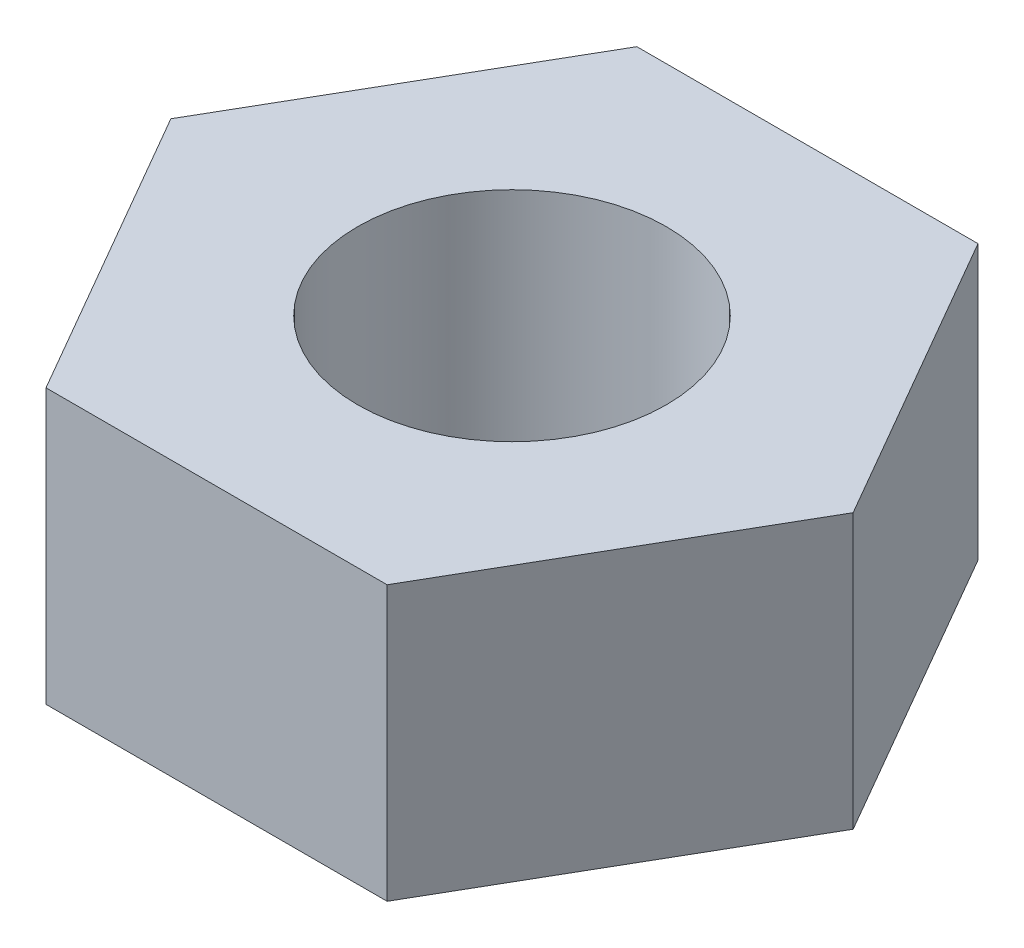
from build123d import *

# Parameters (mm, degrees)
BOSS_EXTRUDE1_DEPTH = 2.6162
SKETCH4_R           = 1.4732
CUT_EXTRUDE1_DEPTH  = 6.039068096


with BuildPart() as part:
    # Sketch-Hex → Boss-Extrude1 (new body)
    with BuildSketch(Plane(origin=(0, 0, 0), x_dir=(1, 0, 0), z_dir=(0, 1, 0))):
        Polygon((3.255562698, 0), (1.627781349, 2.8194), (-1.627781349, 2.8194), (-3.255562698, 0), (-1.627781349, -2.8194), (1.627781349, -2.8194), align=None)
    extrude(amount=BOSS_EXTRUDE1_DEPTH)

    # Sketch4 → Cut-Extrude1 (cut, through all)
    with BuildSketch(Plane.XZ):
        with Locations(Location((0, 0, 0), (0, 0, 270))):
            Circle(SKETCH4_R)
    extrude(amount=-CUT_EXTRUDE1_DEPTH, mode=Mode.SUBTRACT)


solid = part.part
